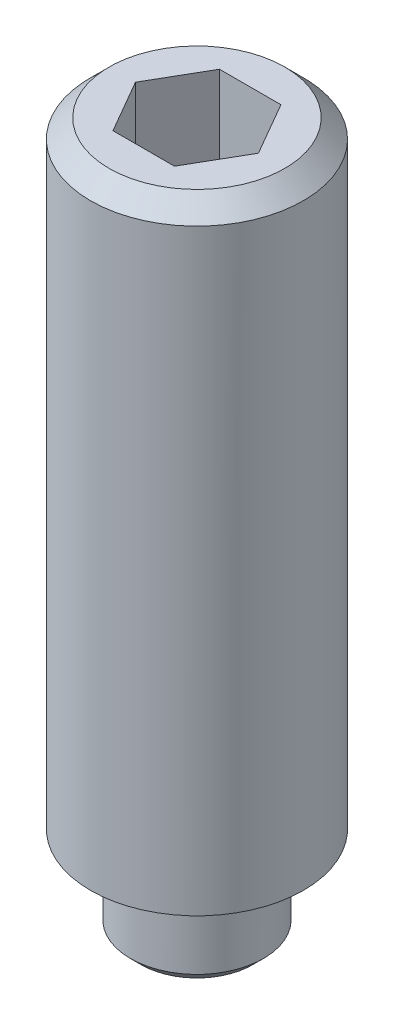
ISO-10303-21;
HEADER;
FILE_DESCRIPTION(('STEP AP214'),'2;1');
FILE_NAME('part.step','',(''),(''),'','','');
FILE_SCHEMA(('AUTOMOTIVE_DESIGN { 1 0 10303 214 1 1 1 1 }'));
ENDSEC;
DATA;
#1=APPLICATION_CONTEXT('core data for automotive mechanical design processes');
#2=APPLICATION_PROTOCOL_DEFINITION('international standard','automotive_design',2000,#1);
#3=PRODUCT_CONTEXT('',#1,'mechanical');
#4=PRODUCT('Part','Part','',(#3));
#5=PRODUCT_RELATED_PRODUCT_CATEGORY('part','',(#4));
#6=PRODUCT_DEFINITION_FORMATION('','',#4);
#7=PRODUCT_DEFINITION_CONTEXT('part definition',#1,'design');
#8=PRODUCT_DEFINITION('design','',#6,#7);
#9=PRODUCT_DEFINITION_SHAPE('','',#8);
#10=(LENGTH_UNIT() NAMED_UNIT(*) SI_UNIT(.MILLI.,.METRE.));
#11=(NAMED_UNIT(*) PLANE_ANGLE_UNIT() SI_UNIT($,.RADIAN.));
#12=(NAMED_UNIT(*) SI_UNIT($,.STERADIAN.) SOLID_ANGLE_UNIT());
#13=UNCERTAINTY_MEASURE_WITH_UNIT(LENGTH_MEASURE(1.E-05),#10,'distance_accuracy_value','');
#14=(GEOMETRIC_REPRESENTATION_CONTEXT(3) GLOBAL_UNCERTAINTY_ASSIGNED_CONTEXT((#13)) GLOBAL_UNIT_ASSIGNED_CONTEXT((#10,
#11,#12)) REPRESENTATION_CONTEXT('',''));
#15=CARTESIAN_POINT('',(0.,0.,0.));
#16=DIRECTION('',(0.,0.,1.));
#17=DIRECTION('',(1.,0.,0.));
#18=AXIS2_PLACEMENT_3D('',#15,#16,#17);
#19=CARTESIAN_POINT('',(0.,12.,0.));
#20=DIRECTION('',(0.,-1.,0.));
#21=DIRECTION('',(0.,0.,-1.));
#22=AXIS2_PLACEMENT_3D('',#19,#20,#21);
#23=CYLINDRICAL_SURFACE('',#22,2.);
#24=CARTESIAN_POINT('',(0.,11.65,0.));
#25=DIRECTION('',(0.,1.,0.));
#26=DIRECTION('',(0.,0.,1.));
#27=AXIS2_PLACEMENT_3D('',#24,#25,#26);
#28=CIRCLE('',#27,2.);
#29=CARTESIAN_POINT('',(0.,11.65,2.));
#30=VERTEX_POINT('',#29);
#31=EDGE_CURVE('E152',#30,#30,#28,.F.);
#32=ORIENTED_EDGE('',*,*,#31,.T.);
#33=EDGE_LOOP('',(#32));
#34=FACE_BOUND('',#33,.T.);
#35=CARTESIAN_POINT('',(0.,0.433012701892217,0.));
#36=DIRECTION('',(0.,1.,0.));
#37=DIRECTION('',(0.,0.,1.));
#38=AXIS2_PLACEMENT_3D('',#35,#36,#37);
#39=CIRCLE('',#38,2.);
#40=CARTESIAN_POINT('',(0.,0.433012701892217,2.));
#41=VERTEX_POINT('',#40);
#42=EDGE_CURVE('E129',#41,#41,#39,.F.);
#43=ORIENTED_EDGE('',*,*,#42,.F.);
#44=EDGE_LOOP('',(#43));
#45=FACE_BOUND('',#44,.T.);
#46=ADVANCED_FACE('F42',(#34,#45),#23,.T.);
#47=CARTESIAN_POINT('',(0.,12.,0.));
#48=DIRECTION('',(0.,1.,0.));
#49=DIRECTION('',(0.,0.,1.));
#50=AXIS2_PLACEMENT_3D('',#47,#48,#49);
#51=PLANE('',#50);
#52=CARTESIAN_POINT('',(0.,12.,0.));
#53=DIRECTION('',(0.,1.,0.));
#54=DIRECTION('',(0.,0.,1.));
#55=AXIS2_PLACEMENT_3D('',#52,#53,#54);
#56=CIRCLE('',#55,1.65);
#57=CARTESIAN_POINT('',(0.,12.,1.65));
#58=VERTEX_POINT('',#57);
#59=EDGE_CURVE('E149',#58,#58,#56,.T.);
#60=ORIENTED_EDGE('',*,*,#59,.T.);
#61=EDGE_LOOP('',(#60));
#62=FACE_BOUND('',#61,.T.);
#63=DIRECTION('',(-1.,0.,0.));
#64=VECTOR('',#63,1.);
#65=CARTESIAN_POINT('',(0.577350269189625,12.,1.));
#66=LINE('',#65,#64);
#67=CARTESIAN_POINT('',(0.577350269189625,12.,1.));
#68=VERTEX_POINT('',#67);
#69=CARTESIAN_POINT('',(-0.577350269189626,12.,1.));
#70=VERTEX_POINT('',#69);
#71=EDGE_CURVE('E138',#68,#70,#66,.T.);
#72=ORIENTED_EDGE('',*,*,#71,.T.);
#73=DIRECTION('',(-0.499999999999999,0.,-0.866025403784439));
#74=VECTOR('',#73,1.);
#75=CARTESIAN_POINT('',(-0.577350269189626,12.,1.));
#76=LINE('',#75,#74);
#77=CARTESIAN_POINT('',(-1.15470053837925,12.,0.));
#78=VERTEX_POINT('',#77);
#79=EDGE_CURVE('E57',#70,#78,#76,.T.);
#80=ORIENTED_EDGE('',*,*,#79,.T.);
#81=DIRECTION('',(0.5,0.,-0.866025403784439));
#82=VECTOR('',#81,1.);
#83=CARTESIAN_POINT('',(-1.15470053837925,12.,0.));
#84=LINE('',#83,#82);
#85=CARTESIAN_POINT('',(-0.577350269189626,12.,-1.));
#86=VERTEX_POINT('',#85);
#87=EDGE_CURVE('E128',#78,#86,#84,.T.);
#88=ORIENTED_EDGE('',*,*,#87,.T.);
#89=DIRECTION('',(1.,0.,0.));
#90=VECTOR('',#89,1.);
#91=CARTESIAN_POINT('',(-0.577350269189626,12.,-1.));
#92=LINE('',#91,#90);
#93=CARTESIAN_POINT('',(0.577350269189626,12.,-1.));
#94=VERTEX_POINT('',#93);
#95=EDGE_CURVE('E132',#86,#94,#92,.T.);
#96=ORIENTED_EDGE('',*,*,#95,.T.);
#97=DIRECTION('',(0.5,0.,0.866025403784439));
#98=VECTOR('',#97,1.);
#99=CARTESIAN_POINT('',(0.577350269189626,12.,-1.));
#100=LINE('',#99,#98);
#101=CARTESIAN_POINT('',(1.15470053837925,12.,0.));
#102=VERTEX_POINT('',#101);
#103=EDGE_CURVE('E135',#94,#102,#100,.T.);
#104=ORIENTED_EDGE('',*,*,#103,.T.);
#105=DIRECTION('',(-0.5,0.,0.866025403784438));
#106=VECTOR('',#105,1.);
#107=CARTESIAN_POINT('',(1.15470053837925,12.,0.));
#108=LINE('',#107,#106);
#109=EDGE_CURVE('E118',#102,#68,#108,.T.);
#110=ORIENTED_EDGE('',*,*,#109,.T.);
#111=EDGE_LOOP('',(#72,#80,#88,#96,#104,#110));
#112=FACE_BOUND('',#111,.T.);
#113=ADVANCED_FACE('F168',(#62,#112),#51,.T.);
#114=CARTESIAN_POINT('',(0.,12.,0.));
#115=DIRECTION('',(0.,-1.,0.));
#116=DIRECTION('',(0.,0.,-1.));
#117=AXIS2_PLACEMENT_3D('',#114,#115,#116);
#118=CONICAL_SURFACE('',#117,1.65,0.785398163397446);
#119=ORIENTED_EDGE('',*,*,#31,.F.);
#120=EDGE_LOOP('',(#119));
#121=FACE_BOUND('',#120,.T.);
#122=ORIENTED_EDGE('',*,*,#59,.F.);
#123=EDGE_LOOP('',(#122));
#124=FACE_BOUND('',#123,.T.);
#125=ADVANCED_FACE('F174',(#121,#124),#118,.T.);
#126=CARTESIAN_POINT('',(-0.577350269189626,9.5,1.));
#127=DIRECTION('',(0.866025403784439,0.,-0.5));
#128=DIRECTION('',(-0.5,0.,-0.866025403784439));
#129=AXIS2_PLACEMENT_3D('',#126,#127,#128);
#130=PLANE('',#129);
#131=ORIENTED_EDGE('',*,*,#79,.F.);
#132=DIRECTION('',(0.,1.,0.));
#133=VECTOR('',#132,1.);
#134=CARTESIAN_POINT('',(-0.577350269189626,9.5,1.));
#135=LINE('',#134,#133);
#136=CARTESIAN_POINT('',(-0.577350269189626,9.5,1.));
#137=VERTEX_POINT('',#136);
#138=EDGE_CURVE('E123',#137,#70,#135,.T.);
#139=ORIENTED_EDGE('',*,*,#138,.F.);
#140=DIRECTION('',(-0.499999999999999,0.,-0.866025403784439));
#141=VECTOR('',#140,1.);
#142=CARTESIAN_POINT('',(-0.577350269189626,9.5,1.));
#143=LINE('',#142,#141);
#144=CARTESIAN_POINT('',(-1.15470053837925,9.5,0.));
#145=VERTEX_POINT('',#144);
#146=EDGE_CURVE('E141',#137,#145,#143,.T.);
#147=ORIENTED_EDGE('',*,*,#146,.T.);
#148=DIRECTION('',(0.,1.,0.));
#149=VECTOR('',#148,1.);
#150=CARTESIAN_POINT('',(-1.15470053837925,9.5,0.));
#151=LINE('',#150,#149);
#152=EDGE_CURVE('E147',#145,#78,#151,.T.);
#153=ORIENTED_EDGE('',*,*,#152,.T.);
#154=EDGE_LOOP('',(#131,#139,#147,#153));
#155=FACE_BOUND('',#154,.T.);
#156=ADVANCED_FACE('F180',(#155),#130,.T.);
#157=CARTESIAN_POINT('',(-1.15470053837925,9.5,0.));
#158=DIRECTION('',(0.866025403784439,0.,0.5));
#159=DIRECTION('',(0.5,0.,-0.866025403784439));
#160=AXIS2_PLACEMENT_3D('',#157,#158,#159);
#161=PLANE('',#160);
#162=ORIENTED_EDGE('',*,*,#87,.F.);
#163=ORIENTED_EDGE('',*,*,#152,.F.);
#164=DIRECTION('',(0.5,0.,-0.866025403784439));
#165=VECTOR('',#164,1.);
#166=CARTESIAN_POINT('',(-1.15470053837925,9.5,0.));
#167=LINE('',#166,#165);
#168=CARTESIAN_POINT('',(-0.577350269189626,9.5,-1.));
#169=VERTEX_POINT('',#168);
#170=EDGE_CURVE('E96',#145,#169,#167,.T.);
#171=ORIENTED_EDGE('',*,*,#170,.T.);
#172=DIRECTION('',(0.,1.,0.));
#173=VECTOR('',#172,1.);
#174=CARTESIAN_POINT('',(-0.577350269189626,9.5,-1.));
#175=LINE('',#174,#173);
#176=EDGE_CURVE('E145',#169,#86,#175,.T.);
#177=ORIENTED_EDGE('',*,*,#176,.T.);
#178=EDGE_LOOP('',(#162,#163,#171,#177));
#179=FACE_BOUND('',#178,.T.);
#180=ADVANCED_FACE('F185',(#179),#161,.T.);
#181=CARTESIAN_POINT('',(-0.577350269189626,9.5,-1.));
#182=DIRECTION('',(0.,0.,1.));
#183=DIRECTION('',(1.,0.,0.));
#184=AXIS2_PLACEMENT_3D('',#181,#182,#183);
#185=PLANE('',#184);
#186=ORIENTED_EDGE('',*,*,#95,.F.);
#187=ORIENTED_EDGE('',*,*,#176,.F.);
#188=DIRECTION('',(1.,0.,0.));
#189=VECTOR('',#188,1.);
#190=CARTESIAN_POINT('',(-0.577350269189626,9.5,-1.));
#191=LINE('',#190,#189);
#192=CARTESIAN_POINT('',(0.577350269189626,9.5,-1.));
#193=VERTEX_POINT('',#192);
#194=EDGE_CURVE('E114',#169,#193,#191,.T.);
#195=ORIENTED_EDGE('',*,*,#194,.T.);
#196=DIRECTION('',(0.,1.,0.));
#197=VECTOR('',#196,1.);
#198=CARTESIAN_POINT('',(0.577350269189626,9.5,-1.));
#199=LINE('',#198,#197);
#200=EDGE_CURVE('E111',#193,#94,#199,.T.);
#201=ORIENTED_EDGE('',*,*,#200,.T.);
#202=EDGE_LOOP('',(#186,#187,#195,#201));
#203=FACE_BOUND('',#202,.T.);
#204=ADVANCED_FACE('F199',(#203),#185,.T.);
#205=CARTESIAN_POINT('',(0.577350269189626,9.5,-1.));
#206=DIRECTION('',(-0.866025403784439,0.,0.5));
#207=DIRECTION('',(0.5,0.,0.866025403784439));
#208=AXIS2_PLACEMENT_3D('',#205,#206,#207);
#209=PLANE('',#208);
#210=ORIENTED_EDGE('',*,*,#103,.F.);
#211=ORIENTED_EDGE('',*,*,#200,.F.);
#212=DIRECTION('',(0.5,0.,0.866025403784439));
#213=VECTOR('',#212,1.);
#214=CARTESIAN_POINT('',(0.577350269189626,9.5,-1.));
#215=LINE('',#214,#213);
#216=CARTESIAN_POINT('',(1.15470053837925,9.5,0.));
#217=VERTEX_POINT('',#216);
#218=EDGE_CURVE('E106',#193,#217,#215,.T.);
#219=ORIENTED_EDGE('',*,*,#218,.T.);
#220=DIRECTION('',(0.,1.,0.));
#221=VECTOR('',#220,1.);
#222=CARTESIAN_POINT('',(1.15470053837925,9.5,0.));
#223=LINE('',#222,#221);
#224=EDGE_CURVE('E110',#217,#102,#223,.T.);
#225=ORIENTED_EDGE('',*,*,#224,.T.);
#226=EDGE_LOOP('',(#210,#211,#219,#225));
#227=FACE_BOUND('',#226,.T.);
#228=ADVANCED_FACE('F109',(#227),#209,.T.);
#229=CARTESIAN_POINT('',(1.15470053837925,9.5,0.));
#230=DIRECTION('',(-0.866025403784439,0.,-0.5));
#231=DIRECTION('',(-0.5,0.,0.866025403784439));
#232=AXIS2_PLACEMENT_3D('',#229,#230,#231);
#233=PLANE('',#232);
#234=ORIENTED_EDGE('',*,*,#109,.F.);
#235=ORIENTED_EDGE('',*,*,#224,.F.);
#236=DIRECTION('',(-0.5,0.,0.866025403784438));
#237=VECTOR('',#236,1.);
#238=CARTESIAN_POINT('',(1.15470053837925,9.5,0.));
#239=LINE('',#238,#237);
#240=CARTESIAN_POINT('',(0.577350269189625,9.5,1.));
#241=VERTEX_POINT('',#240);
#242=EDGE_CURVE('E113',#217,#241,#239,.T.);
#243=ORIENTED_EDGE('',*,*,#242,.T.);
#244=DIRECTION('',(0.,1.,0.));
#245=VECTOR('',#244,1.);
#246=CARTESIAN_POINT('',(0.577350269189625,9.5,1.));
#247=LINE('',#246,#245);
#248=EDGE_CURVE('E87',#241,#68,#247,.T.);
#249=ORIENTED_EDGE('',*,*,#248,.T.);
#250=EDGE_LOOP('',(#234,#235,#243,#249));
#251=FACE_BOUND('',#250,.T.);
#252=ADVANCED_FACE('F116',(#251),#233,.T.);
#253=CARTESIAN_POINT('',(0.577350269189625,9.5,1.));
#254=DIRECTION('',(0.,0.,-1.));
#255=DIRECTION('',(-1.,0.,0.));
#256=AXIS2_PLACEMENT_3D('',#253,#254,#255);
#257=PLANE('',#256);
#258=ORIENTED_EDGE('',*,*,#71,.F.);
#259=ORIENTED_EDGE('',*,*,#248,.F.);
#260=DIRECTION('',(-1.,0.,0.));
#261=VECTOR('',#260,1.);
#262=CARTESIAN_POINT('',(0.577350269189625,9.5,1.));
#263=LINE('',#262,#261);
#264=EDGE_CURVE('E65',#241,#137,#263,.T.);
#265=ORIENTED_EDGE('',*,*,#264,.T.);
#266=ORIENTED_EDGE('',*,*,#138,.T.);
#267=EDGE_LOOP('',(#258,#259,#265,#266));
#268=FACE_BOUND('',#267,.T.);
#269=ADVANCED_FACE('F190',(#268),#257,.T.);
#270=CARTESIAN_POINT('',(-1.73205080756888,9.5,-1.));
#271=DIRECTION('',(0.,-1.,0.));
#272=DIRECTION('',(0.,0.,-1.));
#273=AXIS2_PLACEMENT_3D('',#270,#271,#272);
#274=PLANE('',#273);
#275=ORIENTED_EDGE('',*,*,#146,.F.);
#276=ORIENTED_EDGE('',*,*,#264,.F.);
#277=ORIENTED_EDGE('',*,*,#242,.F.);
#278=ORIENTED_EDGE('',*,*,#218,.F.);
#279=ORIENTED_EDGE('',*,*,#194,.F.);
#280=ORIENTED_EDGE('',*,*,#170,.F.);
#281=EDGE_LOOP('',(#275,#276,#277,#278,#279,#280));
#282=FACE_BOUND('',#281,.T.);
#283=ADVANCED_FACE('F121',(#282),#274,.F.);
#284=CARTESIAN_POINT('',(0.,0.,0.));
#285=DIRECTION('',(0.,1.,0.));
#286=DIRECTION('',(0.,0.,-1.));
#287=AXIS2_PLACEMENT_3D('',#284,#285,#286);
#288=CONICAL_SURFACE('',#287,1.25,1.0471975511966);
#289=CARTESIAN_POINT('',(0.,0.,0.));
#290=DIRECTION('',(0.,-1.,0.));
#291=DIRECTION('',(0.,0.,-1.));
#292=AXIS2_PLACEMENT_3D('',#289,#290,#291);
#293=CIRCLE('',#292,1.25);
#294=CARTESIAN_POINT('',(0.,0.,-1.25));
#295=VERTEX_POINT('',#294);
#296=EDGE_CURVE('E227',#295,#295,#293,.T.);
#297=ORIENTED_EDGE('',*,*,#296,.F.);
#298=EDGE_LOOP('',(#297));
#299=FACE_BOUND('',#298,.T.);
#300=ORIENTED_EDGE('',*,*,#42,.T.);
#301=EDGE_LOOP('',(#300));
#302=FACE_BOUND('',#301,.T.);
#303=ADVANCED_FACE('F216',(#299,#302),#288,.T.);
#304=CARTESIAN_POINT('',(0.,-1.25,0.));
#305=DIRECTION('',(0.,1.,0.));
#306=DIRECTION('',(0.,0.,1.));
#307=AXIS2_PLACEMENT_3D('',#304,#305,#306);
#308=CYLINDRICAL_SURFACE('',#307,1.25);
#309=CARTESIAN_POINT('',(0.,-1.05,0.));
#310=DIRECTION('',(0.,-1.,0.));
#311=DIRECTION('',(0.,0.,-1.));
#312=AXIS2_PLACEMENT_3D('',#309,#310,#311);
#313=CIRCLE('',#312,1.25);
#314=CARTESIAN_POINT('',(0.,-1.05,1.25));
#315=VERTEX_POINT('',#314);
#316=EDGE_CURVE('E12',#315,#315,#313,.F.);
#317=ORIENTED_EDGE('',*,*,#316,.T.);
#318=EDGE_LOOP('',(#317));
#319=FACE_BOUND('',#318,.T.);
#320=ORIENTED_EDGE('',*,*,#296,.T.);
#321=EDGE_LOOP('',(#320));
#322=FACE_BOUND('',#321,.T.);
#323=ADVANCED_FACE('F164',(#319,#322),#308,.T.);
#324=CARTESIAN_POINT('',(0.,-1.25,0.));
#325=DIRECTION('',(0.,-1.,0.));
#326=DIRECTION('',(0.,0.,-1.));
#327=AXIS2_PLACEMENT_3D('',#324,#325,#326);
#328=PLANE('',#327);
#329=CARTESIAN_POINT('',(0.,-1.25,0.));
#330=DIRECTION('',(0.,-1.,0.));
#331=DIRECTION('',(0.,0.,-1.));
#332=AXIS2_PLACEMENT_3D('',#329,#330,#331);
#333=CIRCLE('',#332,1.05);
#334=CARTESIAN_POINT('',(0.,-1.25,1.05));
#335=VERTEX_POINT('',#334);
#336=EDGE_CURVE('E50',#335,#335,#333,.T.);
#337=ORIENTED_EDGE('',*,*,#336,.T.);
#338=EDGE_LOOP('',(#337));
#339=FACE_BOUND('',#338,.T.);
#340=ADVANCED_FACE('F157',(#339),#328,.T.);
#341=CARTESIAN_POINT('',(0.,-1.25,0.));
#342=DIRECTION('',(0.,1.,0.));
#343=DIRECTION('',(0.,0.,1.));
#344=AXIS2_PLACEMENT_3D('',#341,#342,#343);
#345=CONICAL_SURFACE('',#344,1.05,0.785398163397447);
#346=CARTESIAN_POINT('',(0.,-1.05,1.25));
#347=CARTESIAN_POINT('',(0.,-1.05208333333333,1.24791666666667));
#348=CARTESIAN_POINT('',(0.,-1.05416666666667,1.24583333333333));
#349=CARTESIAN_POINT('',(0.,-1.05833333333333,1.24166666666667));
#350=CARTESIAN_POINT('',(0.,-1.06041666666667,1.23958333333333));
#351=CARTESIAN_POINT('',(0.,-1.06458333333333,1.23541666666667));
#352=CARTESIAN_POINT('',(0.,-1.06666666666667,1.23333333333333));
#353=CARTESIAN_POINT('',(0.,-1.07083333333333,1.22916666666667));
#354=CARTESIAN_POINT('',(0.,-1.07291666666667,1.22708333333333));
#355=CARTESIAN_POINT('',(0.,-1.07708333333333,1.22291666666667));
#356=CARTESIAN_POINT('',(0.,-1.07916666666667,1.22083333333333));
#357=CARTESIAN_POINT('',(0.,-1.08333333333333,1.21666666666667));
#358=CARTESIAN_POINT('',(0.,-1.08541666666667,1.21458333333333));
#359=CARTESIAN_POINT('',(0.,-1.08958333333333,1.21041666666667));
#360=CARTESIAN_POINT('',(0.,-1.09166666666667,1.20833333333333));
#361=CARTESIAN_POINT('',(0.,-1.09583333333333,1.20416666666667));
#362=CARTESIAN_POINT('',(0.,-1.09791666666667,1.20208333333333));
#363=CARTESIAN_POINT('',(0.,-1.10208333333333,1.19791666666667));
#364=CARTESIAN_POINT('',(0.,-1.10416666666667,1.19583333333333));
#365=CARTESIAN_POINT('',(0.,-1.10833333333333,1.19166666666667));
#366=CARTESIAN_POINT('',(0.,-1.11041666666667,1.18958333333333));
#367=CARTESIAN_POINT('',(0.,-1.11458333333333,1.18541666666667));
#368=CARTESIAN_POINT('',(0.,-1.11666666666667,1.18333333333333));
#369=CARTESIAN_POINT('',(0.,-1.12083333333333,1.17916666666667));
#370=CARTESIAN_POINT('',(0.,-1.12291666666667,1.17708333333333));
#371=CARTESIAN_POINT('',(0.,-1.12708333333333,1.17291666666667));
#372=CARTESIAN_POINT('',(0.,-1.12916666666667,1.17083333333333));
#373=CARTESIAN_POINT('',(0.,-1.13333333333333,1.16666666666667));
#374=CARTESIAN_POINT('',(0.,-1.13541666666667,1.16458333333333));
#375=CARTESIAN_POINT('',(0.,-1.13958333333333,1.16041666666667));
#376=CARTESIAN_POINT('',(0.,-1.14166666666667,1.15833333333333));
#377=CARTESIAN_POINT('',(0.,-1.14583333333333,1.15416666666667));
#378=CARTESIAN_POINT('',(0.,-1.14791666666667,1.15208333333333));
#379=CARTESIAN_POINT('',(0.,-1.15208333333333,1.14791666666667));
#380=CARTESIAN_POINT('',(0.,-1.15416666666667,1.14583333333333));
#381=CARTESIAN_POINT('',(0.,-1.15833333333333,1.14166666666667));
#382=CARTESIAN_POINT('',(0.,-1.16041666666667,1.13958333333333));
#383=CARTESIAN_POINT('',(0.,-1.16458333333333,1.13541666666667));
#384=CARTESIAN_POINT('',(0.,-1.16666666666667,1.13333333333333));
#385=CARTESIAN_POINT('',(0.,-1.17083333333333,1.12916666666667));
#386=CARTESIAN_POINT('',(0.,-1.17291666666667,1.12708333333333));
#387=CARTESIAN_POINT('',(0.,-1.17708333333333,1.12291666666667));
#388=CARTESIAN_POINT('',(0.,-1.17916666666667,1.12083333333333));
#389=CARTESIAN_POINT('',(0.,-1.18333333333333,1.11666666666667));
#390=CARTESIAN_POINT('',(0.,-1.18541666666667,1.11458333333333));
#391=CARTESIAN_POINT('',(0.,-1.18958333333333,1.11041666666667));
#392=CARTESIAN_POINT('',(0.,-1.19166666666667,1.10833333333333));
#393=CARTESIAN_POINT('',(0.,-1.19583333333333,1.10416666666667));
#394=CARTESIAN_POINT('',(0.,-1.19791666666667,1.10208333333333));
#395=CARTESIAN_POINT('',(0.,-1.20208333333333,1.09791666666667));
#396=CARTESIAN_POINT('',(0.,-1.20416666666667,1.09583333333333));
#397=CARTESIAN_POINT('',(0.,-1.20833333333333,1.09166666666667));
#398=CARTESIAN_POINT('',(0.,-1.21041666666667,1.08958333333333));
#399=CARTESIAN_POINT('',(0.,-1.21458333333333,1.08541666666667));
#400=CARTESIAN_POINT('',(0.,-1.21666666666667,1.08333333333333));
#401=CARTESIAN_POINT('',(0.,-1.22083333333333,1.07916666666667));
#402=CARTESIAN_POINT('',(0.,-1.22291666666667,1.07708333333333));
#403=CARTESIAN_POINT('',(0.,-1.22708333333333,1.07291666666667));
#404=CARTESIAN_POINT('',(0.,-1.22916666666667,1.07083333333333));
#405=CARTESIAN_POINT('',(0.,-1.23333333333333,1.06666666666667));
#406=CARTESIAN_POINT('',(0.,-1.23541666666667,1.06458333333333));
#407=CARTESIAN_POINT('',(0.,-1.23958333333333,1.06041666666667));
#408=CARTESIAN_POINT('',(0.,-1.24166666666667,1.05833333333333));
#409=CARTESIAN_POINT('',(0.,-1.24583333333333,1.05416666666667));
#410=CARTESIAN_POINT('',(0.,-1.24791666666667,1.05208333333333));
#411=CARTESIAN_POINT('',(0.,-1.25,1.05));
#412=B_SPLINE_CURVE_WITH_KNOTS('',3,(#346,#347,#348,#349,#350,#351,#352,#353,#354,#355,#356,
#357,#358,#359,#360,#361,#362,#363,#364,#365,#366,#367,#368,#369,#370,#371,#372,#373,#374,#375,
#376,#377,#378,#379,#380,#381,#382,#383,#384,#385,#386,#387,#388,#389,#390,#391,#392,#393,#394,
#395,#396,#397,#398,#399,#400,#401,#402,#403,#404,#405,#406,#407,#408,#409,#410,#411),
.UNSPECIFIED.,.F.,.F.,(4,2,2,2,2,2,2,2,2,2,2,2,2,2,2,2,2,2,2,2,2,2,2,2,2,2,2,2,2,2,2,2,4),(0.,
0.00883883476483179,0.0176776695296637,0.0265165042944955,0.0353553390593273,0.0441941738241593,
0.053033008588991,0.061871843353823,0.0707106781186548,0.0795495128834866,0.0883883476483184,
0.0972271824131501,0.106066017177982,0.114904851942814,0.123743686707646,0.132582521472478,
0.141421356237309,0.150260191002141,0.159099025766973,0.167937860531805,0.176776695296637,
0.185615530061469,0.1944543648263,0.203293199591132,0.212132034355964,0.220970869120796,
0.229809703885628,0.23864853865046,0.247487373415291,0.256326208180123,0.265165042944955,
0.274003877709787,0.282842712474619),.UNSPECIFIED.);
#413=EDGE_CURVE('BSEAM44',#315,#335,#412,.T.);
#414=ORIENTED_EDGE('',*,*,#316,.F.);
#415=ORIENTED_EDGE('',*,*,#336,.F.);
#416=ORIENTED_EDGE('',*,*,#413,.T.);
#417=ORIENTED_EDGE('',*,*,#413,.F.);
#418=EDGE_LOOP('',(#414,#416,#415,#417));
#419=FACE_BOUND('',#418,.T.);
#420=ADVANCED_FACE('F44',(#419),#345,.T.);
#421=CLOSED_SHELL('',(#46,#113,#125,#156,#180,#204,#228,#252,#269,#283,#303,#323,#340,#420));
#422=MANIFOLD_SOLID_BREP('B2',#421);
#423=ADVANCED_BREP_SHAPE_REPRESENTATION('',(#18,#422),#14);
#424=SHAPE_DEFINITION_REPRESENTATION(#9,#423);
ENDSEC;
END-ISO-10303-21;
